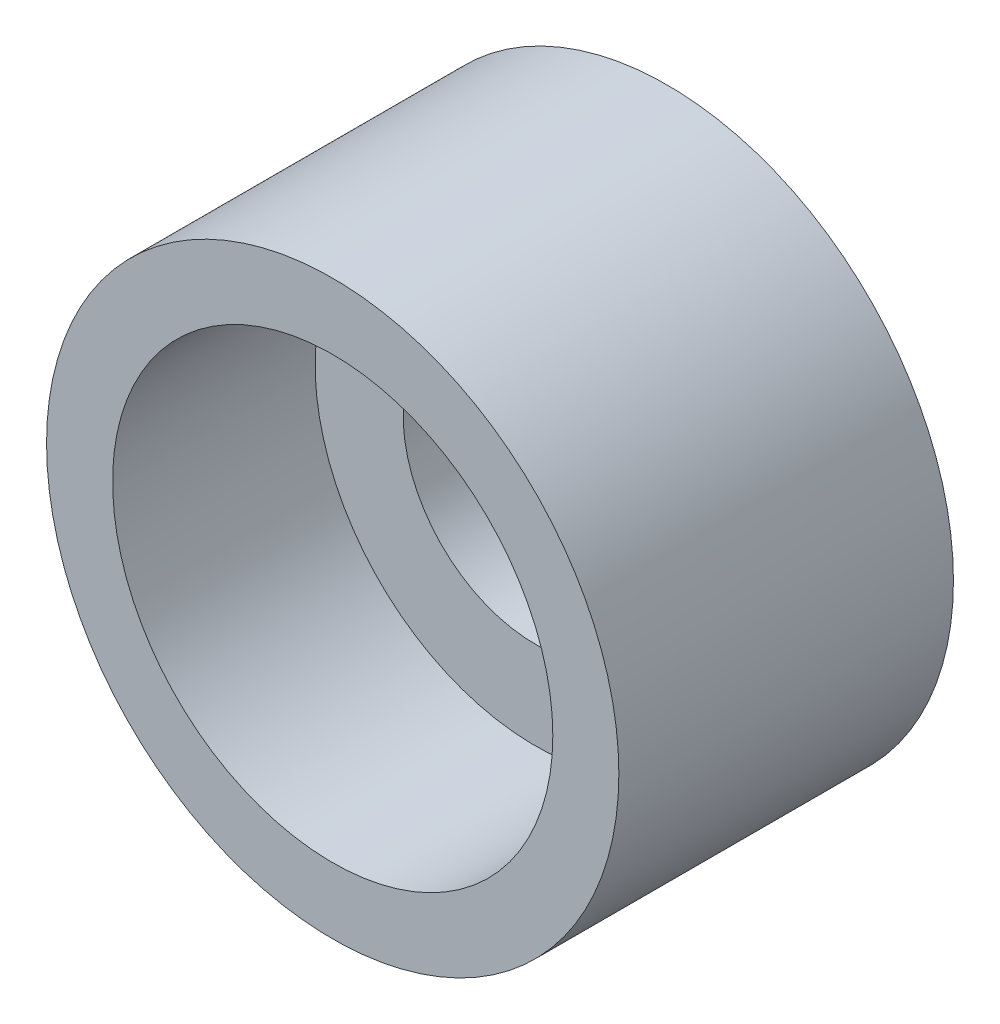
from build123d import *

# Parameters (mm, degrees)
ESQUISSE1_R          = 13
ESQUISSE1_R_2        = 6
BASE_EXTRUSION_DEPTH = 3
EXTRUSION1_START     = 9.2
ESQUISSE2_R          = 13
ESQUISSE2_R_2        = 10
EXTRUSION1_DEPTH     = 9.2


with BuildPart() as part:
    # Esquisse1 → Base-Extrusion (new, symmetric)
    with BuildSketch(Plane.XY):
        Circle(ESQUISSE1_R)
        Circle(ESQUISSE1_R_2, mode=Mode.SUBTRACT)
    extrude(amount=BASE_EXTRUSION_DEPTH, both=True)

    # Esquisse2 → Extrusion1 (add)
    with BuildSketch(Plane.XY.offset(3).offset(EXTRUSION1_START)):
        Circle(ESQUISSE2_R)
        Circle(ESQUISSE2_R_2, mode=Mode.SUBTRACT)
    extrude(amount=-EXTRUSION1_DEPTH)


solid = part.part
